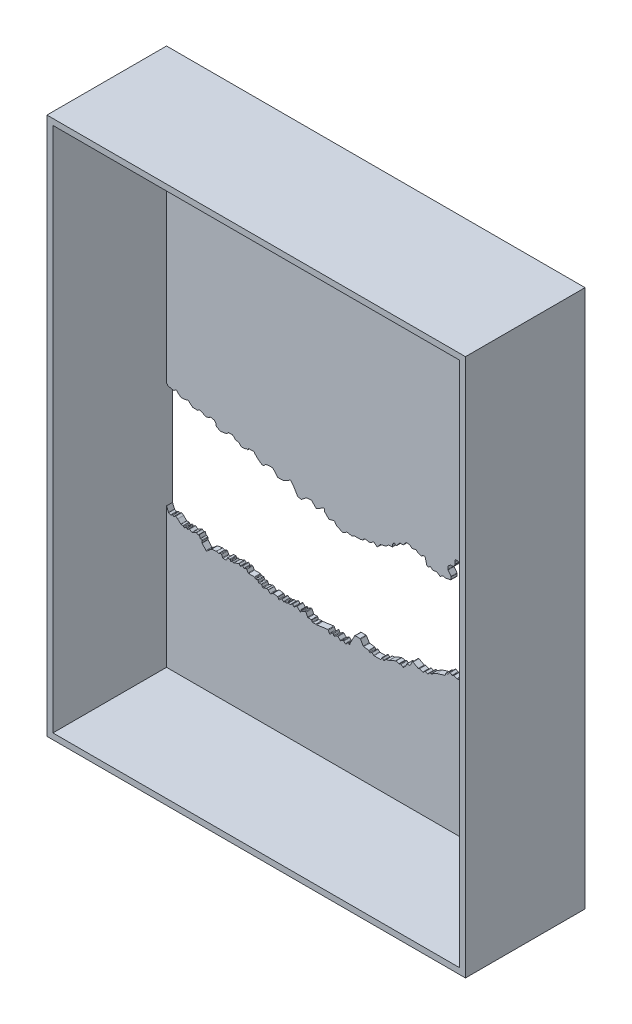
from build123d import *

# Parameters (mm, degrees)
ESQUISSE2_W             = 1400
ESQUISSE2_H             = 1800
BOSS_EXTRU_2_DEPTH      = 200
COQUE1_T                = -20
ENL_V_MAT_EXTRU_1_REACH = 1210.305


with BuildPart() as part:
    # Esquisse2 → Boss.-Extru.2 (new, symmetric)
    with BuildSketch(Plane.XY):
        Rectangle(ESQUISSE2_W, ESQUISSE2_H)
    extrude(amount=BOSS_EXTRU_2_DEPTH, both=True)

    # Coque1
    coque1_openings = [part.faces().sort_by_distance(p)[0] for p in [
        (0, 0, 200),
    ]]
    offset(amount=COQUE1_T, openings=coque1_openings, kind=Kind.INTERSECTION)

    # Esquisse3 → Enl_v. mat.-Extru.1 (cut, up to next)
    with BuildSketch(Plane(origin=(0, 0, -200), x_dir=(-1, 0, 0), z_dir=(0, 0, -1)), mode=Mode.PRIVATE) as enl_v_mat_extru_1_sk1:
        with BuildLine():
            Line((-654.54291398, -114.768213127), (-680, -103.714797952))
            Line((-680, -103.714797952), (-680, -442.152559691))
            Line((-680, -442.152559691), (-667.390305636, -434.878480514))
            ThreePointArc((-667.390305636, -434.878480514), (-665.876675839, -434.678142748), (-664.662759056, -435.604218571))
            Line((-664.662759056, -435.604218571), (-660.566050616, -442.637100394))
            ThreePointArc((-660.566050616, -442.637100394), (-659.445124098, -443.536005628), (-658.01077865, -443.451388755))
            Line((-658.01077865, -443.451388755), (-646.203287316, -438.088355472))
            ThreePointArc((-646.203287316, -438.088355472), (-644.29318571, -438.227924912), (-643.376193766, -439.909321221))
            Line((-643.376193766, -439.909321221), (-643.376193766, -442.489865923))
            ThreePointArc((-643.376193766, -442.489865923), (-642.704127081, -443.985390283), (-641.139600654, -444.475822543))
            Line((-641.139600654, -444.475822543), (-627.604242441, -442.863313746))
            ThreePointArc((-627.604242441, -442.863313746), (-627.302632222, -442.803580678), (-627.013742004, -442.698322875))
            Line((-627.013742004, -442.698322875), (-617.640432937, -438.440909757))
            ThreePointArc((-617.640432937, -438.440909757), (-616.335298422, -438.319846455), (-615.235486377, -439.032900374))
            Line((-615.235486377, -439.032900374), (-611.522286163, -443.800193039))
            ThreePointArc((-611.522286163, -443.800193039), (-611.07992687, -444.2176243), (-610.532554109, -444.482791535))
            Line((-610.532554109, -444.482791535), (-607.392830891, -445.448768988))
            ThreePointArc((-607.392830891, -445.448768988), (-606.443440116, -445.504295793), (-605.575734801, -445.115048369))
            Line((-605.575734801, -445.115048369), (-600.369980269, -441.060334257))
            ThreePointArc((-600.369980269, -441.060334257), (-599.246502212, -440.640971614), (-598.085096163, -440.939641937))
            Line((-598.085096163, -440.939641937), (-596.794924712, -441.7416833))
            ThreePointArc((-596.794924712, -441.7416833), (-595.538558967, -442.033066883), (-594.36555113, -441.496958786))
            Line((-594.36555113, -441.496958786), (-590.852134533, -438.177737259))
            ThreePointArc((-590.852134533, -438.177737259), (-589.421849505, -437.632365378), (-588.024849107, -438.258093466))
            Line((-588.024849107, -438.258093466), (-586.042866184, -440.356034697))
            ThreePointArc((-586.042866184, -440.356034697), (-584.388588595, -440.972499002), (-582.890500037, -440.038479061))
            Line((-582.890500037, -440.038479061), (-582.888270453, -440.034892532))
            Line((-582.888270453, -440.034892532), (-577.827838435, -443.180734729))
            ThreePointArc((-577.827838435, -443.180734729), (-577.078288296, -443.458586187), (-576.279795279, -443.420694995))
            Line((-576.279795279, -443.420694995), (-567.95696119, -441.307752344))
            ThreePointArc((-567.95696119, -441.307752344), (-566.442087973, -441.52753607), (-565.526321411, -442.754123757))
            Line((-565.526321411, -442.754123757), (-565.403562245, -443.237669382))
            Line((-565.403562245, -443.237669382), (-562.569204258, -441.030014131))
            ThreePointArc((-562.569204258, -441.030014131), (-561.093535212, -440.623139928), (-559.762376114, -441.378892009))
            Line((-559.762376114, -441.378892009), (-559.389959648, -441.857028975))
            ThreePointArc((-559.389959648, -441.857028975), (-558.058800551, -442.612781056), (-556.583131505, -442.205906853))
            Line((-556.583131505, -442.205906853), (-549.930527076, -437.024254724))
            ThreePointArc((-549.930527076, -437.024254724), (-548.807049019, -436.604892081), (-547.64564297, -436.903562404))
            Line((-547.64564297, -436.903562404), (-543.802440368, -439.292708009))
            ThreePointArc((-543.802440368, -439.292708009), (-542.546074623, -439.584091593), (-541.373066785, -439.047983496))
            Line((-541.373066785, -439.047983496), (-540.838706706, -438.543158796))
            ThreePointArc((-540.838706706, -438.543158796), (-539.175685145, -438.018051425), (-537.732826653, -438.997611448))
            Line((-537.732826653, -438.997611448), (-535.750353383, -442.43425015))
            ThreePointArc((-535.750353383, -442.43425015), (-535.018253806, -443.166750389), (-534.017937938, -443.434881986))
            Line((-534.017937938, -443.434881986), (-524.532228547, -443.434881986))
            ThreePointArc((-524.532228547, -443.434881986), (-523.118014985, -442.849095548), (-522.532228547, -441.434881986))
            Line((-522.532228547, -441.434881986), (-522.532228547, -439.76546203))
            ThreePointArc((-522.532228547, -439.76546203), (-521.503872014, -438.017346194), (-519.476319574, -438.066916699))
            Line((-519.476319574, -438.066916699), (-512.766510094, -442.238102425))
            ThreePointArc((-512.766510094, -442.238102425), (-511.135514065, -442.455092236), (-509.893741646, -441.37563224))
            Line((-509.893741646, -441.37563224), (-508.058013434, -437.38644513))
            ThreePointArc((-508.058013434, -437.38644513), (-506.934673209, -436.346612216), (-505.405078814, -436.405660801))
            Line((-505.405078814, -436.405660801), (-493.901938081, -441.69913022))
            ThreePointArc((-493.901938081, -441.69913022), (-492.835920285, -441.869008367), (-491.836887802, -441.460123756))
            Line((-491.836887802, -441.460123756), (-487.437200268, -438.033247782))
            ThreePointArc((-487.437200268, -438.033247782), (-485.961531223, -437.626373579), (-484.630372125, -438.38212566))
            Line((-484.630372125, -438.38212566), (-482.251191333, -441.436701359))
            ThreePointArc((-482.251191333, -441.436701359), (-481.551418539, -442.004661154), (-480.673338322, -442.207726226))
            Line((-480.673338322, -442.207726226), (-474.610302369, -442.207726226))
            Line((-474.610302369, -442.207726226), (-467.944178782, -442.207726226))
            Line((-467.944178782, -442.207726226), (-453.54953633, -444.247634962))
            ThreePointArc((-453.54953633, -444.247634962), (-452.559751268, -444.137470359), (-451.745805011, -443.563621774))
            Line((-451.745805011, -443.563621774), (-448.769821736, -440.066676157))
            ThreePointArc((-448.769821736, -440.066676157), (-447.4071604, -439.36932414), (-445.95051099, -439.839768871))
            Line((-445.95051099, -439.839768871), (-442.100261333, -443.116422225))
            ThreePointArc((-442.100261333, -443.116422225), (-440.985663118, -443.585051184), (-439.804691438, -443.325728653))
            Line((-439.804691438, -443.325728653), (-439.031043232, -442.879438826))
            ThreePointArc((-439.031043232, -442.879438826), (-437.742118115, -442.632926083), (-436.577854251, -443.238389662))
            Line((-436.577854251, -443.238389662), (-432.904448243, -447.126712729))
            ThreePointArc((-432.904448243, -447.126712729), (-432.369381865, -447.529730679), (-431.731249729, -447.733463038))
            Line((-431.731249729, -447.733463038), (-427.09659594, -448.390253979))
            ThreePointArc((-427.09659594, -448.390253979), (-425.85823144, -448.165809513), (-424.999114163, -447.246114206))
            Line((-424.999114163, -447.246114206), (-423.170660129, -443.272734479))
            ThreePointArc((-423.170660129, -443.272734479), (-422.667661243, -442.600906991), (-421.933304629, -442.194606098))
            Line((-421.933304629, -442.194606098), (-410.798814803, -438.823762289))
            ThreePointArc((-410.798814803, -438.823762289), (-409.811079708, -438.780072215), (-408.923109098, -439.2148568))
            Line((-408.923109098, -439.2148568), (-407.293657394, -440.601558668))
            Line((-407.293657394, -440.601558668), (-406.71349299, -438.715846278))
            ThreePointArc((-406.71349299, -438.715846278), (-405.73774172, -437.536416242), (-404.213798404, -437.392393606))
            Line((-404.213798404, -437.392393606), (-385.872406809, -443.035365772))
            ThreePointArc((-385.872406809, -443.035365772), (-384.851763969, -443.758714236), (-384.460527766, -444.946939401))
            Line((-384.460527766, -444.946939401), (-384.460527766, -447.57964155))
            ThreePointArc((-384.460527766, -447.57964155), (-384.144592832, -448.65849504), (-383.296602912, -449.396501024))
            Line((-383.296602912, -449.396501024), (-374.551432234, -453.420818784))
            ThreePointArc((-374.551432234, -453.420818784), (-373.140270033, -453.519494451), (-372.016811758, -452.659868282))
            Line((-372.016811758, -452.659868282), (-369.875922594, -449.216013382))
            ThreePointArc((-369.875922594, -449.216013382), (-368.660546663, -448.331162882), (-367.172168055, -448.542889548))
            Line((-367.172168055, -448.542889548), (-365.363850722, -449.594192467))
            ThreePointArc((-365.363850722, -449.594192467), (-363.846820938, -449.79856073), (-362.629608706, -448.870368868))
            Line((-362.629608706, -448.870368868), (-360.834895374, -445.783331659))
            ThreePointArc((-360.834895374, -445.783331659), (-359.335728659, -444.801794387), (-357.652041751, -445.415076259))
            Line((-357.652041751, -445.415076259), (-355.546536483, -447.643766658))
            ThreePointArc((-355.546536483, -447.643766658), (-354.244645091, -448.264523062), (-352.863740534, -447.848155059))
            Line((-352.863740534, -447.848155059), (-352.356021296, -447.452697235))
            ThreePointArc((-352.356021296, -447.452697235), (-351.262070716, -447.035113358), (-350.121836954, -447.301517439))
            Line((-350.121836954, -447.301517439), (-345.738500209, -449.849861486))
            ThreePointArc((-345.738500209, -449.849861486), (-344.73666591, -450.120825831), (-343.733922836, -449.853244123))
            Line((-343.733922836, -449.853244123), (-336.252567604, -445.537519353))
            Line((-336.252567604, -445.537519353), (-335.449127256, -446.38796595))
            Line((-335.449127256, -446.38796595), (-334.357258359, -445.537519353))
            Line((-334.357258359, -445.537519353), (-327.308928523, -449.6352126))
            ThreePointArc((-327.308928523, -449.6352126), (-326.53583628, -449.892664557), (-325.72421534, -449.820383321))
            Line((-325.72421534, -449.820383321), (-320.552987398, -448.25485118))
            ThreePointArc((-320.552987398, -448.25485118), (-320.036714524, -448.013750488), (-319.609382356, -447.636849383))
            Line((-319.609382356, -447.636849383), (-314.851681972, -442.046287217))
            ThreePointArc((-314.851681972, -442.046287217), (-314.375260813, -440.793433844), (-314.796937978, -439.521110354))
            Line((-314.796937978, -439.521110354), (-314.922283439, -439.360182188))
            ThreePointArc((-314.922283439, -439.360182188), (-315.339867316, -438.266231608), (-315.073463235, -437.125997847))
            Line((-315.073463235, -437.125997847), (-311.395813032, -430.800172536))
            ThreePointArc((-311.395813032, -430.800172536), (-310.178600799, -429.871980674), (-308.661571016, -430.076348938))
            Line((-308.661571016, -430.076348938), (-307.432865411, -430.790682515))
            ThreePointArc((-307.432865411, -430.790682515), (-306.090179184, -431.032971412), (-304.904547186, -430.357851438))
            Line((-304.904547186, -430.357851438), (-301.386211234, -426.223611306))
            ThreePointArc((-301.386211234, -426.223611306), (-300.422764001, -425.599714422), (-299.274981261, -425.608239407))
            Line((-299.274981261, -425.608239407), (-294.132804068, -427.190298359))
            ThreePointArc((-294.132804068, -427.190298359), (-293.183413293, -427.245825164), (-292.315707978, -426.85657774))
            Line((-292.315707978, -426.85657774), (-292.08161552, -426.674245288))
            Line((-292.08161552, -426.674245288), (-281.224227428, -423.387290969))
            ThreePointArc((-281.224227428, -423.387290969), (-280.412606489, -423.315009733), (-279.639514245, -423.572461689))
            Line((-279.639514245, -423.572461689), (-277.066055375, -425.068595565))
            ThreePointArc((-277.066055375, -425.068595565), (-276.100526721, -425.339169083), (-275.125023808, -425.107113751))
            Line((-275.125023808, -425.107113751), (-268.35132504, -421.520807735))
            ThreePointArc((-268.35132504, -421.520807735), (-266.827381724, -421.376785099), (-265.647951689, -422.352536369))
            Line((-265.647951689, -422.352536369), (-262.633480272, -428.046172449))
            ThreePointArc((-262.633480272, -428.046172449), (-261.897519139, -428.823774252), (-260.865929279, -429.11035009))
            Line((-260.865929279, -429.11035009), (-255.968461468, -429.11035009))
            ThreePointArc((-255.968461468, -429.11035009), (-254.77661583, -429.504266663), (-254.054257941, -430.530846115))
            Line((-254.054257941, -430.530846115), (-252.314763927, -436.276700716))
            ThreePointArc((-252.314763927, -436.276700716), (-251.817955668, -437.108221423), (-250.988681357, -437.608770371))
            Line((-250.988681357, -437.608770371), (-222.875626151, -446.258124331))
            Line((-222.875626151, -446.258124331), (-205.78358627, -456.194937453))
            ThreePointArc((-205.78358627, -456.194937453), (-205.010494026, -456.452389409), (-204.198873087, -456.380108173))
            Line((-204.198873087, -456.380108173), (-201.601809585, -455.593875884))
            ThreePointArc((-201.601809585, -455.593875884), (-200.416863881, -455.601920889), (-199.4444526, -456.279104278))
            Line((-199.4444526, -456.279104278), (-195.287280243, -461.616402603))
            ThreePointArc((-195.287280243, -461.616402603), (-194.187468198, -462.329456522), (-192.882333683, -462.20839322))
            Line((-192.882333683, -462.20839322), (-186.296827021, -459.217216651))
            ThreePointArc((-186.296827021, -459.217216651), (-185.098893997, -459.072863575), (-184.03593554, -459.643828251))
            Line((-184.03593554, -459.643828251), (-178.906561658, -464.918302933))
            ThreePointArc((-178.906561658, -464.918302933), (-177.843603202, -465.489267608), (-176.645670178, -465.344914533))
            Line((-176.645670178, -465.344914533), (-166.7376329, -460.844624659))
            ThreePointArc((-166.7376329, -460.844624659), (-165.539699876, -460.700271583), (-164.47674142, -461.271236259))
            Line((-164.47674142, -461.271236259), (-164.238555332, -461.516160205))
            ThreePointArc((-164.238555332, -461.516160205), (-163.115906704, -462.097454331), (-161.868935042, -461.889357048))
            Line((-161.868935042, -461.889357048), (-144.571613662, -452.731363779))
            ThreePointArc((-144.571613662, -452.731363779), (-143.047670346, -452.587341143), (-141.86824031, -453.563092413))
            Line((-141.86824031, -453.563092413), (-134.905963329, -466.713215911))
            ThreePointArc((-134.905963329, -466.713215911), (-134.170002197, -467.490817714), (-133.138412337, -467.777393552))
            Line((-133.138412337, -467.777393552), (-131.706960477, -467.777393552))
            Line((-131.706960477, -467.777393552), (-124.606157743, -467.777393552))
            ThreePointArc((-124.606157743, -467.777393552), (-123.414312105, -468.171310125), (-122.691954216, -469.197889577))
            Line((-122.691954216, -469.197889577), (-120.791248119, -475.476256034))
            ThreePointArc((-120.791248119, -475.476256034), (-120.599912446, -475.912491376), (-120.310842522, -476.291106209))
            Line((-120.310842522, -476.291106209), (-113.378338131, -483.419718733))
            ThreePointArc((-113.378338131, -483.419718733), (-112.082039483, -484.020632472), (-110.715565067, -483.603217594))
            Line((-110.715565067, -483.603217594), (-104.721757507, -478.934696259))
            ThreePointArc((-104.721757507, -478.934696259), (-103.722725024, -478.525811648), (-102.656707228, -478.695689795))
            Line((-102.656707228, -478.695689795), (-98.517294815, -480.600548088))
            ThreePointArc((-98.517294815, -480.600548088), (-97.818428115, -480.778976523), (-97.101715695, -480.69789214))
            Line((-97.101715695, -480.69789214), (-87.662627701, -477.84031251))
            ThreePointArc((-87.662627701, -477.84031251), (-86.945915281, -477.759228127), (-86.247048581, -477.937656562))
            Line((-86.247048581, -477.937656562), (-76.479672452, -482.432368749))
            Line((-76.479672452, -482.432368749), (-64.311590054, -488.031828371))
            ThreePointArc((-64.311590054, -488.031828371), (-64.039806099, -488.133712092), (-63.756137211, -488.195183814))
            Line((-63.756137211, -488.195183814), (-55.770120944, -489.326906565))
            ThreePointArc((-55.770120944, -489.326906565), (-55.144863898, -489.524039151), (-54.616945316, -489.912767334))
            Line((-54.616945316, -489.912767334), (-48.725443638, -495.970929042))
            ThreePointArc((-48.725443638, -495.970929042), (-47.319536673, -496.576380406), (-45.897291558, -496.010372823))
            Line((-45.897291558, -496.010372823), (-42.404536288, -492.613703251))
            ThreePointArc((-42.404536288, -492.613703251), (-40.510166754, -492.111013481), (-39.095978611, -493.467997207))
            Line((-39.095978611, -493.467997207), (-37.772983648, -497.838082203))
            ThreePointArc((-37.772983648, -497.838082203), (-37.050625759, -498.864661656), (-35.858780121, -499.258578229))
            Line((-35.858780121, -499.258578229), (-14.226174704, -499.258578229))
            ThreePointArc((-14.226174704, -499.258578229), (-13.473710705, -499.111629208), (-12.831820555, -498.69237616))
            Line((-12.831820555, -498.69237616), (-7.928117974, -493.923574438))
            ThreePointArc((-7.928117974, -493.923574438), (-6.50587286, -493.357566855), (-5.099965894, -493.96301822))
            Line((-5.099965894, -493.96301822), (-2.408935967, -496.730172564))
            ThreePointArc((-2.408935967, -496.730172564), (-0.730905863, -497.320850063), (0.75389477, -496.341027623))
            Line((0.75389477, -496.341027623), (2.468420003, -493.391919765))
            ThreePointArc((2.468420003, -493.391919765), (3.099095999, -492.725718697), (3.960859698, -492.411172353))
            Line((3.960859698, -492.411172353), (20.503971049, -490.440340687))
            ThreePointArc((20.503971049, -490.440340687), (21.365734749, -490.125794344), (21.996410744, -489.459593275))
            Line((21.996410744, -489.459593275), (31.05172451, -473.883796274))
            ThreePointArc((31.05172451, -473.883796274), (31.783365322, -473.155451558), (32.780757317, -472.889005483))
            Line((32.780757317, -472.889005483), (48.863068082, -472.889005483))
            ThreePointArc((48.863068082, -472.889005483), (49.894657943, -473.175581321), (50.630619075, -473.953183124))
            Line((50.630619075, -473.953183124), (66.268257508, -503.48904864))
            ThreePointArc((66.268257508, -503.48904864), (66.441724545, -503.942741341), (66.500706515, -504.424870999))
            Line((66.500706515, -504.424870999), (66.500706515, -505.805767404))
            ThreePointArc((66.500706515, -505.805767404), (67.722473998, -507.648144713), (69.895060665, -507.239565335))
            Line((69.895060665, -507.239565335), (71.038740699, -506.127347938))
            ThreePointArc((71.038740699, -506.127347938), (72.460985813, -505.561340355), (73.866892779, -506.16679172))
            Line((73.866892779, -506.16679172), (79.668196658, -512.132204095))
            ThreePointArc((79.668196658, -512.132204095), (81.074103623, -512.73765546), (82.496348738, -512.171647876))
            Line((82.496348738, -512.171647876), (87.226486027, -507.571636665))
            ThreePointArc((87.226486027, -507.571636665), (88.376608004, -507.020402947), (89.626049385, -507.276401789))
            Line((89.626049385, -507.276401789), (96.73064639, -511.406807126))
            ThreePointArc((96.73064639, -511.406807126), (97.980087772, -511.662805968), (99.130209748, -511.11157225))
            Line((99.130209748, -511.11157225), (106.420812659, -504.021533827))
            ThreePointArc((106.420812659, -504.021533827), (107.570934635, -503.470300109), (108.820376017, -503.726298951))
            Line((108.820376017, -503.726298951), (117.819230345, -508.957970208))
            ThreePointArc((117.819230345, -508.957970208), (119.427794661, -509.135757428), (120.641299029, -508.065012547))
            Line((120.641299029, -508.065012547), (122.550340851, -503.916508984))
            ThreePointArc((122.550340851, -503.916508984), (124.028669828, -502.781443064), (125.800998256, -503.35822998))
            Line((125.800998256, -503.35822998), (131.865731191, -509.594523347))
            ThreePointArc((131.865731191, -509.594523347), (133.638059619, -510.171310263), (135.116388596, -509.036244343))
            Line((135.116388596, -509.036244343), (138.545106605, -501.585360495))
            ThreePointArc((138.545106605, -501.585360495), (139.404223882, -500.665665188), (140.642588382, -500.441220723))
            Line((140.642588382, -500.441220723), (177.716794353, -505.695119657))
            Line((177.716794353, -505.695119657), (180.217619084, -504.938022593))
            Line((180.217619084, -504.938022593), (190.054631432, -506.33205565))
            ThreePointArc((190.054631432, -506.33205565), (191.292995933, -506.107611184), (192.15211321, -505.187915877))
            Line((192.15211321, -505.187915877), (194.150073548, -500.846185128))
            ThreePointArc((194.150073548, -500.846185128), (194.888079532, -499.998195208), (195.966933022, -499.682260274))
            Line((195.966933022, -499.682260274), (206.141798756, -499.682260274))
            ThreePointArc((206.141798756, -499.682260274), (207.220652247, -499.36632534), (207.958658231, -498.51833542))
            Line((207.958658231, -498.51833542), (213.241016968, -487.039339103))
            ThreePointArc((213.241016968, -487.039339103), (214.454521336, -485.968594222), (216.063085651, -486.146381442))
            Line((216.063085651, -486.146381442), (224.712687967, -491.175007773))
            ThreePointArc((224.712687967, -491.175007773), (226.229717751, -491.379376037), (227.446929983, -490.451184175))
            Line((227.446929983, -490.451184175), (228.597990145, -488.47127714))
            Line((228.597990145, -488.47127714), (230.091847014, -487.680360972))
            Line((230.091847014, -487.680360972), (230.091847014, -493.53809691))
            ThreePointArc((230.091847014, -493.53809691), (231.313614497, -495.380474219), (233.486201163, -494.971894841))
            Line((233.486201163, -494.971894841), (243.316671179, -485.411861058))
            ThreePointArc((243.316671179, -485.411861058), (244.738916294, -484.845853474), (246.144823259, -485.451304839))
            Line((246.144823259, -485.451304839), (251.294268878, -490.746419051))
            ThreePointArc((251.294268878, -490.746419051), (252.700175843, -491.351870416), (254.122420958, -490.785862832))
            Line((254.122420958, -490.785862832), (258.190542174, -486.829655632))
            ThreePointArc((258.190542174, -486.829655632), (259.612787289, -486.263648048), (261.018694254, -486.869099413))
            Line((261.018694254, -486.869099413), (264.887192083, -490.847030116))
            ThreePointArc((264.887192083, -490.847030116), (265.818985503, -491.388648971), (266.896559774, -491.368066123))
            Line((266.896559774, -491.368066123), (271.801149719, -489.894249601))
            ThreePointArc((271.801149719, -489.894249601), (272.610877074, -489.823394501), (273.381928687, -490.080606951))
            Line((273.381928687, -490.080606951), (278.878796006, -493.276325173))
            ThreePointArc((278.878796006, -493.276325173), (280.395825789, -493.480693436), (281.613038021, -492.552501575))
            Line((281.613038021, -492.552501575), (281.657766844, -492.475564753))
            ThreePointArc((281.657766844, -492.475564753), (283.142567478, -491.495742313), (284.820597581, -492.086419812))
            Line((284.820597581, -492.086419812), (286.165298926, -493.469160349))
            ThreePointArc((286.165298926, -493.469160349), (287.571205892, -494.074611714), (288.993451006, -493.508604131))
            Line((288.993451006, -493.508604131), (293.312374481, -489.308494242))
            ThreePointArc((293.312374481, -489.308494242), (294.734619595, -488.742486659), (296.140526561, -489.347938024))
            Line((296.140526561, -489.347938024), (301.832235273, -495.200654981))
            ThreePointArc((301.832235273, -495.200654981), (303.632188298, -495.772497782), (305.105637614, -494.59106552))
            Line((305.105637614, -494.59106552), (306.913198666, -490.353875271))
            ThreePointArc((306.913198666, -490.353875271), (307.553484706, -489.538128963), (308.516209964, -489.152683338))
            Line((308.516209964, -489.152683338), (323.130090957, -487.41168681))
            ThreePointArc((323.130090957, -487.41168681), (323.944827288, -487.483028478), (324.662885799, -487.874534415))
            Line((324.662885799, -487.874534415), (330.66835755, -492.985332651))
            ThreePointArc((330.66835755, -492.985332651), (332.125006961, -493.455777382), (333.487668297, -492.758425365))
            Line((333.487668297, -492.758425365), (339.337391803, -485.884675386))
            ThreePointArc((339.337391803, -485.884675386), (339.766443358, -485.506649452), (340.284931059, -485.26548696))
            Line((340.284931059, -485.26548696), (344.552176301, -483.983190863))
            ThreePointArc((344.552176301, -483.983190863), (345.238995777, -483.901677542), (345.912510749, -484.05897661))
            Line((345.912510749, -484.05897661), (356.334178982, -488.504800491))
            ThreePointArc((356.334178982, -488.504800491), (357.864827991, -488.520905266), (358.95854808, -487.449960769))
            Line((358.95854808, -487.449960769), (361.485698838, -481.5259459))
            ThreePointArc((361.485698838, -481.5259459), (362.34301937, -480.568551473), (363.60592555, -480.33049567))
            Line((363.60592555, -480.33049567), (369.974036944, -481.23294018))
            ThreePointArc((369.974036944, -481.23294018), (371.236943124, -480.994884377), (372.094263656, -480.03748995))
            Line((372.094263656, -480.03748995), (373.98256692, -475.611028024))
            ThreePointArc((373.98256692, -475.611028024), (374.839887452, -474.653633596), (376.102793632, -474.415577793))
            Line((376.102793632, -474.415577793), (381.26367703, -475.146942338))
            ThreePointArc((381.26367703, -475.146942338), (382.417301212, -474.966135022), (383.273332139, -474.171936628))
            Line((383.273332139, -474.171936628), (384.546097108, -471.982688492))
            ThreePointArc((384.546097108, -471.982688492), (385.27773792, -471.254343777), (386.275129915, -470.987897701))
            Line((386.275129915, -470.987897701), (405.242318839, -470.987897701))
            ThreePointArc((405.242318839, -470.987897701), (406.239710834, -470.721451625), (406.971351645, -469.99310691))
            Line((406.971351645, -469.99310691), (411.516077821, -462.175847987))
            ThreePointArc((411.516077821, -462.175847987), (412.615059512, -461.282890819), (414.029875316, -461.341452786))
            Line((414.029875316, -461.341452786), (419.013958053, -463.467633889))
            ThreePointArc((419.013958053, -463.467633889), (420.164877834, -463.594226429), (421.19307689, -463.06182741))
            Line((421.19307689, -463.06182741), (425.005965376, -459.353831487))
            ThreePointArc((425.005965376, -459.353831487), (426.42821049, -458.787823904), (427.834117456, -459.393275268))
            Line((427.834117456, -459.393275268), (430.910085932, -462.556257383))
            ThreePointArc((430.910085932, -462.556257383), (432.315992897, -463.161708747), (433.738238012, -462.595701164))
            Line((433.738238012, -462.595701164), (437.315751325, -459.116605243))
            ThreePointArc((437.315751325, -459.116605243), (438.343950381, -458.584206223), (439.494870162, -458.710798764))
            Line((439.494870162, -458.710798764), (454.639459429, -465.171393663))
            ThreePointArc((454.639459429, -465.171393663), (455.59729619, -465.324286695), (456.514425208, -465.008530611))
            Line((456.514425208, -465.008530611), (459.232312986, -463.24138614))
            ThreePointArc((459.232312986, -463.24138614), (460.737260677, -462.96160373), (461.999255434, -463.827926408))
            Line((461.999255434, -463.827926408), (462.522577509, -464.632801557))
            ThreePointArc((462.522577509, -464.632801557), (464.37239094, -465.535097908), (466.038923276, -464.327365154))
            Line((466.038923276, -464.327365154), (466.983472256, -462.113202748))
            ThreePointArc((466.983472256, -462.113202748), (467.720699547, -461.229206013), (468.823076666, -460.897967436))
            Line((468.823076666, -460.897967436), (475.382304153, -460.897967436))
            ThreePointArc((475.382304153, -460.897967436), (476.575799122, -461.293109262), (477.29769431, -462.322397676))
            Line((477.29769431, -462.322397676), (479.078644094, -468.249070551))
            ThreePointArc((479.078644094, -468.249070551), (479.800539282, -469.278358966), (480.994034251, -469.673500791))
            Line((480.994034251, -469.673500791), (490.702241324, -469.673500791))
            ThreePointArc((490.702241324, -469.673500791), (491.804618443, -469.342262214), (492.541845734, -468.458265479))
            Line((492.541845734, -468.458265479), (495.739364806, -460.962808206))
            ThreePointArc((495.739364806, -460.962808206), (496.833084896, -459.891863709), (498.363733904, -459.907968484))
            Line((498.363733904, -459.907968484), (504.178306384, -462.388431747))
            ThreePointArc((504.178306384, -462.388431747), (504.851821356, -462.545730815), (505.538640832, -462.464217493))
            Line((505.538640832, -462.464217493), (512.442769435, -460.389544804))
            ThreePointArc((512.442769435, -460.389544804), (512.867345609, -460.310642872), (513.298961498, -460.324720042))
            Line((513.298961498, -460.324720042), (529.293686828, -462.591381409))
            ThreePointArc((529.293686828, -462.591381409), (529.833935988, -462.747817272), (530.309266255, -463.048487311))
            Line((530.309266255, -463.048487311), (545.348612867, -475.847326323))
            ThreePointArc((545.348612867, -475.847326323), (546.805262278, -476.317771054), (548.167923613, -475.620419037))
            Line((548.167923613, -475.620419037), (560.760521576, -460.823417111))
            ThreePointArc((560.760521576, -460.823417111), (561.114407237, -460.21778832), (561.23741256, -459.527215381))
            Line((561.23741256, -459.527215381), (561.23741256, -454.534448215))
            ThreePointArc((561.23741256, -454.534448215), (561.55601625, -453.451440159), (562.41031901, -452.713482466))
            Line((562.41031901, -452.713482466), (566.078637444, -451.047310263))
            ThreePointArc((566.078637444, -451.047310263), (566.682015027, -450.624111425), (567.091148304, -450.011109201))
            Line((567.091148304, -450.011109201), (570.800601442, -441.31560282))
            Line((570.800601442, -441.31560282), (571.902253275, -443.009955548))
            ThreePointArc((571.902253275, -443.009955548), (573.164248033, -443.876278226), (574.669195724, -443.596495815))
            Line((574.669195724, -443.596495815), (579.637621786, -440.366073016))
            ThreePointArc((579.637621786, -440.366073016), (580.554750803, -440.050316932), (581.512587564, -440.203209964))
            Line((581.512587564, -440.203209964), (591.307726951, -444.381760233))
            ThreePointArc((591.307726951, -444.381760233), (591.920729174, -444.79089351), (592.343928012, -445.394271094))
            Line((592.343928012, -445.394271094), (592.365869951, -445.442579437))
            ThreePointArc((592.365869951, -445.442579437), (593.626496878, -446.535387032), (595.277036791, -446.292227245))
            Line((595.277036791, -446.292227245), (602.760068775, -441.426831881))
            ThreePointArc((602.760068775, -441.426831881), (604.07264417, -441.115974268), (605.284067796, -441.70921909))
            Line((605.284067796, -441.70921909), (608.080070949, -444.584316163))
            ThreePointArc((608.080070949, -444.584316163), (609.758101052, -445.174993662), (611.242901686, -444.195171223))
            Line((611.242901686, -444.195171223), (611.764665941, -443.297698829))
            ThreePointArc((611.764665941, -443.297698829), (612.981878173, -442.369506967), (614.498907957, -442.573875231))
            Line((614.498907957, -442.573875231), (619.478691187, -445.468975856))
            ThreePointArc((619.478691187, -445.468975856), (620.99572097, -445.67334412), (622.212933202, -444.745152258))
            Line((622.212933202, -444.745152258), (623.481307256, -442.563456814))
            ThreePointArc((623.481307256, -442.563456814), (624.212948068, -441.835112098), (625.210340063, -441.568666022))
            Line((625.210340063, -441.568666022), (631.263954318, -441.568666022))
            ThreePointArc((631.263954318, -441.568666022), (632.016418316, -441.421717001), (632.658308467, -441.002463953))
            Line((632.658308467, -441.002463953), (642.663445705, -431.272568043))
            ThreePointArc((642.663445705, -431.272568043), (642.809597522, -431.143678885), (642.967598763, -431.029624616))
            Line((642.967598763, -431.029624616), (649.012080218, -427.099560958))
            ThreePointArc((649.012080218, -427.099560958), (650.56343893, -426.83019501), (651.828963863, -427.767061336))
            Line((651.828963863, -427.767061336), (653.073380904, -429.896100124))
            ThreePointArc((653.073380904, -429.896100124), (654.292755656, -430.821449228), (655.809304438, -430.613541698))
            Line((655.809304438, -430.613541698), (658.541175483, -429.01677094))
            ThreePointArc((658.541175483, -429.01677094), (659.577663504, -428.743639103), (660.606325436, -429.044908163))
            Line((660.606325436, -429.044908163), (665.087345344, -431.830556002))
            ThreePointArc((665.087345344, -431.830556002), (666.116007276, -432.131825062), (667.152495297, -431.858693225))
            Line((667.152495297, -431.858693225), (672.484823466, -428.741962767))
            ThreePointArc((672.484823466, -428.741962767), (672.975843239, -428.337860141), (673.315186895, -427.8000449))
            Line((673.315186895, -427.8000449), (680, -412.129855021))
            Line((680, -412.129855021), (680, -57.316072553))
            Line((680, -57.316072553), (678.857892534, -57.554342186))
            ThreePointArc((678.857892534, -57.554342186), (677.68416987, -58.269047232), (677.224232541, -59.563993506))
            Line((677.224232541, -59.563993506), (677.224232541, -60.027852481))
            ThreePointArc((677.224232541, -60.027852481), (676.76231501, -61.325230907), (675.584430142, -62.038775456))
            Line((675.584430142, -62.038775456), (657.407536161, -65.772969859))
            ThreePointArc((657.407536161, -65.772969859), (656.662548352, -65.78796349), (655.961282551, -65.536054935))
            Line((655.961282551, -65.536054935), (648.418700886, -61.143448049))
            ThreePointArc((648.418700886, -61.143448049), (647.020449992, -60.897265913), (645.796826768, -61.617305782))
            Line((645.796826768, -61.617305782), (643.155480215, -64.84493671))
            ThreePointArc((643.155480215, -64.84493671), (642.989652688, -65.024585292), (642.803644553, -65.183246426))
            Line((642.803644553, -65.183246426), (632.076089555, -73.28166103))
            ThreePointArc((632.076089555, -73.28166103), (631.491434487, -73.589749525), (630.839188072, -73.69612003))
            Line((630.839188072, -73.69612003), (621.207723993, -73.69612003))
            ThreePointArc((621.207723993, -73.69612003), (620.944064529, -73.67911854), (620.684772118, -73.628395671))
            Line((620.684772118, -73.628395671), (608.610089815, -70.447610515))
            ThreePointArc((608.610089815, -70.447610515), (607.621743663, -70.433334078), (606.741288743, -70.882590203))
            Line((606.741288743, -70.882590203), (604.138109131, -73.14259105))
            Line((604.138109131, -73.14259105), (593.327517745, -82.528015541))
            ThreePointArc((593.327517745, -82.528015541), (592.719114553, -82.893694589), (592.022543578, -83.030312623))
            Line((592.022543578, -83.030312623), (576.288494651, -83.343650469))
            ThreePointArc((576.288494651, -83.343650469), (575.576638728, -83.231308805), (574.947469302, -82.879875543))
            Line((574.947469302, -82.879875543), (570.417673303, -79.172896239))
            ThreePointArc((570.417673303, -79.172896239), (569.382339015, -78.725865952), (568.2670943, -78.893145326))
            Line((568.2670943, -78.893145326), (561.23741256, -82.092653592))
            Line((561.23741256, -82.092653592), (548.245102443, -88.006008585))
            ThreePointArc((548.245102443, -88.006008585), (547.568499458, -88.183067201), (546.871721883, -88.122715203))
            Line((546.871721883, -88.122715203), (538.07589585, -85.805666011))
            ThreePointArc((538.07589585, -85.805666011), (537.372161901, -85.466593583), (536.846039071, -84.889180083))
            Line((536.846039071, -84.889180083), (535.260110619, -82.288069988))
            ThreePointArc((535.260110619, -82.288069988), (534.326225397, -81.474269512), (533.094185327, -81.345855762))
            Line((533.094185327, -81.345855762), (521.20334817, -83.788665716))
            ThreePointArc((521.20334817, -83.788665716), (520.558432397, -84.040314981), (520.0338294, -84.492017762))
            Line((520.0338294, -84.492017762), (514.318235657, -91.409960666))
            ThreePointArc((514.318235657, -91.409960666), (513.969097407, -92.02274594), (513.847952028, -92.717531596))
            Line((513.847952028, -92.717531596), (513.847952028, -96.862851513))
            ThreePointArc((513.847952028, -96.862851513), (513.585067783, -97.867964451), (512.863741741, -98.615660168))
            Line((512.863741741, -98.615660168), (502.154556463, -105.145180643))
            ThreePointArc((502.154556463, -105.145180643), (501.640871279, -105.368839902), (501.085847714, -105.445291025))
            Line((501.085847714, -105.445291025), (495.040987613, -105.445291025))
            ThreePointArc((495.040987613, -105.445291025), (494.851234, -105.436502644), (494.663105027, -105.410212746))
            Line((494.663105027, -105.410212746), (479.506681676, -102.571857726))
            Line((479.506681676, -102.571857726), (476.3586443, -99.99564692))
            ThreePointArc((476.3586443, -99.99564692), (476.178995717, -99.829819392), (476.020334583, -99.643811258))
            Line((476.020334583, -99.643811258), (474.029901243, -97.00718617))
            ThreePointArc((474.029901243, -97.00718617), (473.30665101, -96.406462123), (472.391441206, -96.191168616))
            Line((472.391441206, -96.191168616), (460.25447809, -96.191168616))
            ThreePointArc((460.25447809, -96.191168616), (459.602231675, -96.297539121), (459.017576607, -96.605627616))
            Line((459.017576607, -96.605627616), (454.920707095, -99.698424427))
            Line((454.920707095, -99.698424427), (449.737105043, -104.99863103))
            ThreePointArc((449.737105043, -104.99863103), (449.255613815, -105.363758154), (448.688676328, -105.572883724))
            Line((448.688676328, -105.572883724), (445.6725944, -106.202107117))
            Line((445.6725944, -106.202107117), (438.119888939, -107.77777352))
            ThreePointArc((438.119888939, -107.77777352), (437.518977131, -108.005928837), (437.018073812, -108.4087262))
            Line((437.018073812, -108.4087262), (430.821454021, -115.24525888))
            ThreePointArc((430.821454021, -115.24525888), (430.132281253, -115.743370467), (429.300379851, -115.919479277))
            Line((429.300379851, -115.919479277), (417.798948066, -115.919479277))
            ThreePointArc((417.798948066, -115.919479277), (417.023889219, -115.76754955), (416.36354944, -115.334247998))
            Line((416.36354944, -115.334247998), (414.603327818, -113.612751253))
            ThreePointArc((414.603327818, -113.612751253), (413.743746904, -113.10992879), (412.748670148, -113.070787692))
            Line((412.748670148, -113.070787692), (408.865187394, -113.880970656))
            ThreePointArc((408.865187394, -113.880970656), (407.150982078, -113.464301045), (406.393009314, -111.871319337))
            Line((406.393009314, -111.871319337), (406.393009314, -110.928900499))
            ThreePointArc((406.393009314, -110.928900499), (405.79172325, -109.477267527), (404.340090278, -108.875981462))
            Line((404.340090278, -108.875981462), (387.762589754, -108.875981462))
            ThreePointArc((387.762589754, -108.875981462), (386.310956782, -109.477267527), (385.709670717, -110.928900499))
            Line((385.709670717, -110.928900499), (385.709670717, -111.193517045))
            ThreePointArc((385.709670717, -111.193517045), (385.55774099, -111.968575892), (385.124439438, -112.628915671))
            Line((385.124439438, -112.628915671), (377.500494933, -120.42435996))
            Line((377.500494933, -120.42435996), (362.087467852, -132.607942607))
            ThreePointArc((362.087467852, -132.607942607), (361.48827169, -132.936592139), (360.814397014, -133.05034396))
            Line((360.814397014, -133.05034396), (355.822167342, -133.05034396))
            ThreePointArc((355.822167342, -133.05034396), (355.047108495, -132.898414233), (354.386768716, -132.465112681))
            Line((354.386768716, -132.465112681), (348.748666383, -126.951048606))
            ThreePointArc((348.748666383, -126.951048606), (348.260719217, -126.597524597), (347.691150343, -126.400895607))
            Line((347.691150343, -126.400895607), (337.710468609, -124.531805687))
            Line((337.710468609, -124.531805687), (326.174738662, -124.531805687))
            ThreePointArc((326.174738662, -124.531805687), (325.378585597, -124.692472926), (324.707050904, -125.149326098))
            Line((324.707050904, -125.149326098), (316.979855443, -133.05034396))
            Line((316.979855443, -133.05034396), (308.970602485, -143.066950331))
            ThreePointArc((308.970602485, -143.066950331), (308.256755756, -143.635088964), (307.367227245, -143.837814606))
            Line((307.367227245, -143.837814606), (302.261415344, -143.837814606))
            Line((302.261415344, -143.837814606), (291.737477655, -143.837814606))
            Line((291.737477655, -143.837814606), (291.726898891, -143.829355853))
            Line((291.726898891, -143.829355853), (273.198175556, -135.272893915))
            ThreePointArc((273.198175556, -135.272893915), (272.97960809, -135.15544424), (272.776806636, -135.012483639))
            Line((272.776806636, -135.012483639), (267.015768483, -130.405972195))
            ThreePointArc((267.015768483, -130.405972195), (265.506505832, -129.969040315), (264.130338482, -130.727292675))
            Line((264.130338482, -130.727292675), (255.746257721, -141.212669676))
            Line((255.746257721, -141.212669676), (252.688623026, -146.462959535))
            Line((252.688623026, -146.462959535), (241.85221129, -165.070251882))
            ThreePointArc((241.85221129, -165.070251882), (241.278619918, -165.702490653), (240.497462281, -166.046766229))
            Line((240.497462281, -166.046766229), (230.091847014, -168.217614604))
            ThreePointArc((230.091847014, -168.217614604), (229.195755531, -168.204737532), (228.390533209, -167.811338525))
            Line((228.390533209, -167.811338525), (212.644360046, -155.220738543))
            ThreePointArc((212.644360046, -155.220738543), (212.217754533, -154.95791895), (211.740187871, -154.806273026))
            Line((211.740187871, -154.806273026), (206.438193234, -153.813364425))
            Line((206.438193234, -153.813364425), (194.685683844, -153.813364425))
            ThreePointArc((194.685683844, -153.813364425), (193.796155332, -154.016090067), (193.082308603, -154.584228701))
            Line((193.082308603, -154.584228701), (188.942252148, -159.761904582))
            Line((188.942252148, -159.761904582), (180.217619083, -168.682797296))
            ThreePointArc((180.217619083, -168.682797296), (179.025381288, -169.281754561), (177.716794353, -169.021406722))
            Line((177.716794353, -169.021406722), (168.971358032, -163.928288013))
            Line((168.971358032, -163.928288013), (154.688994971, -155.610604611))
            ThreePointArc((154.688994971, -155.610604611), (152.632742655, -155.604806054), (151.602938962, -157.384612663))
            Line((151.602938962, -157.384612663), (151.602938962, -163.346853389))
            ThreePointArc((151.602938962, -163.346853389), (151.451009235, -164.121912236), (151.017707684, -164.782252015))
            Line((151.017707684, -164.782252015), (137.55288915, -178.549960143))
            ThreePointArc((137.55288915, -178.549960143), (136.631736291, -179.093393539), (135.562249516, -179.099756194))
            Line((135.562249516, -179.099756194), (119.721469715, -174.926883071))
            ThreePointArc((119.721469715, -174.926883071), (118.398710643, -175.021367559), (117.409695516, -175.904808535))
            Line((117.409695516, -175.904808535), (113.009502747, -183.719167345))
            ThreePointArc((113.009502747, -183.719167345), (112.622205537, -184.211966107), (112.104266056, -184.564936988))
            Line((112.104266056, -184.564936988), (91.745811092, -194.272471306))
            ThreePointArc((91.745811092, -194.272471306), (90.792545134, -194.471168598), (89.854956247, -194.208254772))
            Line((89.854956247, -194.208254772), (76.660362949, -186.778502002))
            ThreePointArc((76.660362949, -186.778502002), (75.970247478, -186.539051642), (75.239977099, -186.556401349))
            Line((75.239977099, -186.556401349), (59.941861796, -189.699190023))
            ThreePointArc((59.941861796, -189.699190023), (59.211591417, -189.71653973), (58.521475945, -189.47708937))
            Line((58.521475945, -189.47708937), (51.074463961, -185.283746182))
            ThreePointArc((51.074463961, -185.283746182), (50.587852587, -185.086770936), (50.067194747, -185.019649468))
            Line((50.067194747, -185.019649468), (35.053218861, -185.019649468))
            Line((35.053218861, -185.019649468), (31.630066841, -185.019649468))
            Line((31.630066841, -185.019649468), (23.024829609, -182.75280632))
            ThreePointArc((23.024829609, -182.75280632), (21.921734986, -182.02078735), (21.494862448, -180.767611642))
            Line((21.494862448, -180.767611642), (21.494862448, -180.510811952))
            ThreePointArc((21.494862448, -180.510811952), (21.22175002, -179.487696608), (20.475080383, -178.7368039))
            Line((20.475080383, -178.7368039), (16.789705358, -176.590535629))
            ThreePointArc((16.789705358, -176.590535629), (16.29162991, -176.382578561), (15.756568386, -176.311624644))
            Line((15.756568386, -176.311624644), (12.663089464, -176.311624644))
            Line((12.663089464, -176.311624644), (0.839109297, -178.740699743))
            ThreePointArc((0.839109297, -178.740699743), (0.032853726, -178.744700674), (-0.712761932, -178.437908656))
            Line((-0.712761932, -178.437908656), (-11.929208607, -170.96027754))
            ThreePointArc((-11.929208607, -170.96027754), (-13.150983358, -170.617169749), (-14.341034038, -171.057891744))
            Line((-14.341034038, -171.057891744), (-23.196157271, -178.057628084))
            ThreePointArc((-23.196157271, -178.057628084), (-24.707839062, -178.486115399), (-26.079745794, -177.720181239))
            Line((-26.079745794, -177.720181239), (-34.24035189, -167.396482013))
            ThreePointArc((-34.24035189, -167.396482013), (-34.726279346, -166.952062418), (-35.327917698, -166.684358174))
            Line((-35.327917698, -166.684358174), (-54.180984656, -161.717970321))
            ThreePointArc((-54.180984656, -161.717970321), (-54.670819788, -161.51847972), (-55.093431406, -161.200463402))
            Line((-55.093431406, -161.200463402), (-62.048306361, -154.398595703))
            ThreePointArc((-62.048306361, -154.398595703), (-62.70864614, -153.965294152), (-63.483704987, -153.813364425))
            Line((-63.483704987, -153.813364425), (-74.426753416, -153.813364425))
            ThreePointArc((-74.426753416, -153.813364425), (-75.878386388, -153.21207836), (-76.479672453, -151.760445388))
            Line((-76.479672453, -151.760445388), (-76.479672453, -144.861367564))
            ThreePointArc((-76.479672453, -144.861367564), (-76.593424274, -144.187492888), (-76.922073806, -143.588296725))
            Line((-76.922073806, -143.588296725), (-79.847142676, -139.88789373))
            ThreePointArc((-79.847142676, -139.88789373), (-81.219049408, -139.12195957), (-82.730731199, -139.550446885))
            Line((-82.730731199, -139.550446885), (-86.936371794, -142.874892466))
            ThreePointArc((-86.936371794, -142.874892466), (-88.448053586, -143.303379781), (-89.819960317, -142.537445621))
            Line((-89.819960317, -142.537445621), (-97.827971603, -132.406788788))
            Line((-97.827971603, -132.406788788), (-99.515121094, -130.272434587))
            ThreePointArc((-99.515121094, -130.272434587), (-100.230941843, -129.697805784), (-101.125638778, -129.492586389))
            Line((-101.125638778, -129.492586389), (-110.939431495, -129.492586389))
            ThreePointArc((-110.939431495, -129.492586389), (-111.83412843, -129.287366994), (-112.549949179, -128.712738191))
            Line((-112.549949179, -128.712738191), (-118.332335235, -121.397642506))
            Line((-118.332335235, -121.397642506), (-120.650206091, -118.465384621))
            ThreePointArc((-120.650206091, -118.465384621), (-121.36602684, -117.890755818), (-122.260723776, -117.685536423))
            Line((-122.260723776, -117.685536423), (-131.706960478, -117.685536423))
            ThreePointArc((-131.706960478, -117.685536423), (-132.380835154, -117.799288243), (-132.980031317, -118.127937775))
            Line((-132.980031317, -118.127937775), (-141.008039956, -124.473862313))
            ThreePointArc((-141.008039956, -124.473862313), (-141.861867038, -124.872999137), (-142.80406267, -124.848539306))
            Line((-142.80406267, -124.848539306), (-153.145069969, -122.124449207))
            ThreePointArc((-153.145069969, -122.124449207), (-154.087265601, -122.099989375), (-154.941092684, -122.4991262))
            Line((-154.941092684, -122.4991262), (-160.101619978, -126.578383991))
            Line((-160.101619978, -126.578383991), (-170.846429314, -131.701837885))
            ThreePointArc((-170.846429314, -131.701837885), (-172.194986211, -131.848368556), (-173.34053263, -131.121869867))
            Line((-173.34053263, -131.121869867), (-176.315586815, -127.358232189))
            ThreePointArc((-176.315586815, -127.358232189), (-177.031407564, -126.783603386), (-177.926104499, -126.578383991))
            Line((-177.926104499, -126.578383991), (-183.031198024, -126.578383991))
            ThreePointArc((-183.031198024, -126.578383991), (-184.284373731, -127.005256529), (-185.016392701, -128.108351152))
            Line((-185.016392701, -128.108351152), (-187.430973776, -137.274421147))
            Line((-187.430973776, -137.274421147), (-190.649279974, -149.491538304))
            ThreePointArc((-190.649279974, -149.491538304), (-191.381298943, -150.594632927), (-192.634474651, -151.021505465))
            Line((-192.634474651, -151.021505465), (-196.63472552, -151.021505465))
            ThreePointArc((-196.63472552, -151.021505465), (-197.529422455, -150.81628607), (-198.245243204, -150.241657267))
            Line((-198.245243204, -150.241657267), (-200.287973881, -147.657469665))
            ThreePointArc((-200.287973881, -147.657469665), (-201.659880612, -146.891535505), (-203.171562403, -147.320022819))
            Line((-203.171562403, -147.320022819), (-210.607983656, -153.198313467))
            ThreePointArc((-210.607983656, -153.198313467), (-211.435353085, -153.591748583), (-212.35148589, -153.586087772))
            Line((-212.35148589, -153.586087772), (-222.405194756, -151.219276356))
            ThreePointArc((-222.405194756, -151.219276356), (-223.216394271, -151.193129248), (-223.974331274, -151.483404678))
            Line((-223.974331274, -151.483404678), (-234.35143808, -158.057974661))
            ThreePointArc((-234.35143808, -158.057974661), (-235.477037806, -158.376553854), (-236.593904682, -158.028594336))
            Line((-236.593904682, -158.028594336), (-243.440942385, -153.434827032))
            ThreePointArc((-243.440942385, -153.434827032), (-244.180398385, -153.126897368), (-244.981406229, -153.125385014))
            Line((-244.981406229, -153.125385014), (-253.554285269, -154.813816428))
            ThreePointArc((-253.554285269, -154.813816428), (-253.994033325, -154.852058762), (-254.431791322, -154.795412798))
            Line((-254.431791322, -154.795412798), (-270.097324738, -151.021505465))
            Line((-270.097324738, -151.021505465), (-270.113944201, -151.021505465))
            ThreePointArc((-270.113944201, -151.021505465), (-271.565577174, -150.420219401), (-272.166863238, -148.968586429))
            Line((-272.166863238, -148.968586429), (-272.166863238, -141.74570061))
            ThreePointArc((-272.166863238, -141.74570061), (-272.064628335, -141.105928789), (-271.768106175, -140.529877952))
            Line((-271.768106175, -140.529877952), (-266.583774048, -133.476443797))
            Line((-266.583774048, -133.476443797), (-261.912400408, -127.120904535))
            ThreePointArc((-261.912400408, -127.120904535), (-261.615878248, -126.544853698), (-261.513643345, -125.905081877))
            Line((-261.513643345, -125.905081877), (-261.513643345, -116.223947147))
            ThreePointArc((-261.513643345, -116.223947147), (-261.73483341, -115.296992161), (-262.350739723, -114.569785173))
            Line((-262.350739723, -114.569785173), (-269.554804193, -109.274738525))
            ThreePointArc((-269.554804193, -109.274738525), (-270.13085503, -108.978216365), (-270.770626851, -108.875981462))
            Line((-270.770626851, -108.875981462), (-273.970540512, -108.875981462))
            ThreePointArc((-273.970540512, -108.875981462), (-274.234199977, -108.858979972), (-274.493492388, -108.808257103))
            Line((-274.493492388, -108.808257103), (-280.39159861, -107.254542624))
            ThreePointArc((-280.39159861, -107.254542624), (-281.17811938, -106.850410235), (-281.72168559, -106.152933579))
            Line((-281.72168559, -106.152933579), (-284.599512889, -100.117609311))
            ThreePointArc((-284.599512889, -100.117609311), (-284.748799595, -99.686979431), (-284.799393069, -99.234023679))
            Line((-284.799393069, -99.234023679), (-284.799393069, -92.683912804))
            Line((-284.799393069, -92.683912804), (-285.825795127, -85.963643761))
            ThreePointArc((-285.825795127, -85.963643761), (-286.639358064, -84.61943449), (-288.165133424, -84.244210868))
            Line((-288.165133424, -84.244210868), (-306.376795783, -87.025719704))
            ThreePointArc((-306.376795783, -87.025719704), (-307.647733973, -86.810440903), (-308.539787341, -85.87991974))
            Line((-308.539787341, -85.87991974), (-312.729109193, -77.094154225))
            ThreePointArc((-312.729109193, -77.094154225), (-314.081559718, -75.986788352), (-315.796923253, -76.322808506))
            Line((-315.796923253, -76.322808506), (-318.219332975, -78.100938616))
            ThreePointArc((-318.219332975, -78.100938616), (-319.434758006, -78.498926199), (-320.649930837, -78.100169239))
            Line((-320.649930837, -78.100169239), (-325.341021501, -74.652179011))
            ThreePointArc((-325.341021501, -74.652179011), (-326.112401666, -74.302108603), (-326.959454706, -74.293288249))
            Line((-326.959454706, -74.293288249), (-336.252567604, -76.151910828))
            ThreePointArc((-336.252567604, -76.151910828), (-336.872625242, -76.180228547), (-337.472804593, -76.021930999))
            Line((-337.472804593, -76.021930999), (-350.357885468, -70.427254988))
            ThreePointArc((-350.357885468, -70.427254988), (-350.958064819, -70.268957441), (-351.578122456, -70.297275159))
            Line((-351.578122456, -70.297275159), (-358.797361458, -71.74112296))
            ThreePointArc((-358.797361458, -71.74112296), (-359.942506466, -72.405498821), (-360.443957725, -73.630773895))
            Line((-360.443957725, -73.630773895), (-360.613701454, -76.449533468))
            ThreePointArc((-360.613701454, -76.449533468), (-360.960489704, -77.473410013), (-361.779322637, -78.179170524))
            Line((-361.779322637, -78.179170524), (-362.627377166, -78.583548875))
            ThreePointArc((-362.627377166, -78.583548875), (-363.324853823, -79.127115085), (-363.728986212, -79.913635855))
            Line((-363.728986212, -79.913635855), (-364.756239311, -83.813224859))
            ThreePointArc((-364.756239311, -83.813224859), (-365.1603717, -84.59974563), (-365.857848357, -85.14331184))
            Line((-365.857848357, -85.14331184), (-368.166113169, -86.243963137))
            Line((-368.166113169, -86.243963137), (-368.894440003, -87.234872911))
            ThreePointArc((-368.894440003, -87.234872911), (-369.292881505, -88.486689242), (-368.850795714, -89.723766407))
            Line((-368.850795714, -89.723766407), (-366.510879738, -92.683912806))
            Line((-366.510879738, -92.683912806), (-364.122410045, -95.705482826))
            ThreePointArc((-364.122410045, -95.705482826), (-363.72327322, -96.559309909), (-363.747733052, -97.501505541))
            Line((-363.747733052, -97.501505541), (-364.991839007, -102.224296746))
            ThreePointArc((-364.991839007, -102.224296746), (-365.259543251, -102.825935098), (-365.703962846, -103.311862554))
            Line((-365.703962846, -103.311862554), (-370.384979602, -107.012080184))
            Line((-370.384979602, -107.012080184), (-370.439359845, -107.012080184))
            ThreePointArc((-370.439359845, -107.012080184), (-371.890992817, -107.613366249), (-372.492278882, -109.064999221))
            Line((-372.492278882, -109.064999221), (-372.492278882, -111.853104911))
            ThreePointArc((-372.492278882, -111.853104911), (-372.697498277, -112.747801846), (-373.27212708, -113.463622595))
            Line((-373.27212708, -113.463622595), (-376.717988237, -116.187483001))
            Line((-376.717988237, -116.187483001), (-381.50379599, -119.97053509))
            ThreePointArc((-381.50379599, -119.97053509), (-381.958115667, -120.242601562), (-382.466914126, -120.389403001))
            Line((-382.466914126, -120.389403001), (-388.882674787, -121.369296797))
            ThreePointArc((-388.882674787, -121.369296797), (-389.682880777, -121.333432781), (-390.408450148, -120.994073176))
            Line((-390.408450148, -120.994073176), (-394.37672098, -118.07736147))
            ThreePointArc((-394.37672098, -118.07736147), (-395.408775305, -117.686846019), (-396.493923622, -117.887074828))
            Line((-396.493923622, -117.887074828), (-400.366731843, -119.779711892))
            ThreePointArc((-400.366731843, -119.779711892), (-400.785635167, -119.930681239), (-401.227236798, -119.987775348))
            Line((-401.227236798, -119.987775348), (-403.567826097, -120.03438733))
            ThreePointArc((-403.567826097, -120.03438733), (-403.838502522, -120.021891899), (-404.105175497, -119.973856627))
            Line((-404.105175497, -119.973856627), (-413.1594063, -117.717212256))
            ThreePointArc((-413.1594063, -117.717212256), (-413.729024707, -117.479631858), (-414.202288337, -117.083486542))
            Line((-414.202288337, -117.083486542), (-417.295016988, -113.578394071))
            ThreePointArc((-417.295016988, -113.578394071), (-417.508774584, -113.369083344), (-417.750684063, -113.193063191))
            Line((-417.750684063, -113.193063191), (-421.710819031, -110.731725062))
            ThreePointArc((-421.710819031, -110.731725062), (-422.687010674, -110.42520896), (-423.689905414, -110.62795113))
            Line((-423.689905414, -110.62795113), (-430.617902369, -113.985881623))
            ThreePointArc((-430.617902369, -113.985881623), (-431.053954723, -114.139390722), (-431.51329942, -114.191440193))
            Line((-431.51329942, -114.191440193), (-432.222303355, -114.191440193))
            ThreePointArc((-432.222303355, -114.191440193), (-433.066722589, -114.009732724), (-433.761659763, -113.49677681))
            Line((-433.761659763, -113.49677681), (-434.765077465, -112.359570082))
            ThreePointArc((-434.765077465, -112.359570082), (-436.176376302, -111.668904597), (-437.662689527, -112.178469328))
            Line((-437.662689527, -112.178469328), (-442.865889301, -116.769527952))
            ThreePointArc((-442.865889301, -116.769527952), (-443.827459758, -117.244400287), (-444.897284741, -117.169593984))
            Line((-444.897284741, -117.169593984), (-449.175470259, -115.684710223))
            ThreePointArc((-449.175470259, -115.684710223), (-450.533835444, -115.688947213), (-451.592196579, -116.54044333))
            Line((-451.592196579, -116.54044333), (-455.546465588, -122.902608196))
            ThreePointArc((-455.546465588, -122.902608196), (-456.604826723, -123.754104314), (-457.963191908, -123.758341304))
            Line((-457.963191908, -123.758341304), (-467.271038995, -120.527749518))
            ThreePointArc((-467.271038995, -120.527749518), (-468.064463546, -120.417779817), (-468.839575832, -120.619811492))
            Line((-468.839575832, -120.619811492), (-470.965546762, -121.650248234))
            ThreePointArc((-470.965546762, -121.650248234), (-471.664032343, -122.20377149), (-472.062131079, -123.001134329))
            Line((-472.062131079, -123.001134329), (-473.513718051, -128.825270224))
            ThreePointArc((-473.513718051, -128.825270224), (-473.911816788, -129.622633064), (-474.610302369, -130.17615632))
            Line((-474.610302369, -130.17615632), (-481.206047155, -133.373047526))
            ThreePointArc((-481.206047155, -133.373047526), (-481.423874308, -133.463566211), (-481.650647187, -133.528499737))
            Line((-481.650647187, -133.528499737), (-488.907716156, -135.161935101))
            ThreePointArc((-488.907716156, -135.161935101), (-489.991050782, -135.112164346), (-490.897869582, -134.517378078))
            Line((-490.897869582, -134.517378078), (-494.675188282, -130.236416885))
            ThreePointArc((-494.675188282, -130.236416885), (-495.148451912, -129.84027157), (-495.718070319, -129.602691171))
            Line((-495.718070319, -129.602691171), (-506.725463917, -126.859247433))
            ThreePointArc((-506.725463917, -126.859247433), (-507.770642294, -126.872997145), (-508.67357126, -127.399595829))
            Line((-508.67357126, -127.399595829), (-514.149133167, -132.875157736))
            ThreePointArc((-514.149133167, -132.875157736), (-514.815148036, -133.320174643), (-515.600766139, -133.4764438))
            Line((-515.600766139, -133.4764438), (-522.532228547, -133.4764438))
            ThreePointArc((-522.532228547, -133.4764438), (-523.549375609, -133.20674893), (-524.299274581, -132.468524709))
            Line((-524.299274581, -132.468524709), (-528.393635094, -125.545152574))
            ThreePointArc((-528.393635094, -125.545152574), (-528.92804763, -124.948479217), (-529.650117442, -124.601735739))
            Line((-529.650117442, -124.601735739), (-540.915381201, -121.709165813))
            ThreePointArc((-540.915381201, -121.709165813), (-541.637451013, -121.362422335), (-542.171863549, -120.765748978))
            Line((-542.171863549, -120.765748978), (-548.553980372, -109.97388792))
            ThreePointArc((-548.553980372, -109.97388792), (-549.81046272, -109.030471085), (-551.366026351, -109.251841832))
            Line((-551.366026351, -109.251841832), (-560.248070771, -114.504526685))
            ThreePointArc((-560.248070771, -114.504526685), (-561.327748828, -114.790106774), (-562.39716401, -114.468218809))
            Line((-562.39716401, -114.468218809), (-571.148887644, -108.885214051))
            ThreePointArc((-571.148887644, -108.885214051), (-572.218302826, -108.563326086), (-573.297980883, -108.848906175))
            Line((-573.297980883, -108.848906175), (-582.888270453, -114.520434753))
            ThreePointArc((-582.888270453, -114.520434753), (-583.94510882, -114.806273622), (-584.9985803, -114.508265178))
            Line((-584.9985803, -114.508265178), (-595.167435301, -108.335191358))
            ThreePointArc((-595.167435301, -108.335191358), (-595.36969769, -108.195163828), (-595.553758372, -108.031947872))
            Line((-595.553758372, -108.031947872), (-599.269622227, -104.316084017))
            ThreePointArc((-599.269622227, -104.316084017), (-599.935637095, -103.871067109), (-600.721255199, -103.714797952))
            Line((-600.721255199, -103.714797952), (-610.097144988, -103.714797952))
            ThreePointArc((-610.097144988, -103.714797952), (-610.882763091, -103.871067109), (-611.54877796, -104.316084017))
            Line((-611.54877796, -104.316084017), (-621.777998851, -114.545304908))
            ThreePointArc((-621.777998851, -114.545304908), (-622.44401372, -114.990321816), (-623.229631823, -115.146590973))
            Line((-623.229631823, -115.146590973), (-631.857578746, -115.146590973))
            ThreePointArc((-631.857578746, -115.146590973), (-632.942469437, -114.836511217), (-633.699629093, -113.999942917))
            Line((-633.699629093, -113.999942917), (-636.231319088, -108.854130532))
            ThreePointArc((-636.231319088, -108.854130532), (-637.411673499, -107.817044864), (-638.979640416, -107.918351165))
            Line((-638.979640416, -107.918351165), (-652.819016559, -114.727190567))
            ThreePointArc((-652.819016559, -114.727190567), (-653.676449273, -114.937478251), (-654.54291398, -114.768213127))
        make_face()
    enl_v_mat_extru_1_tool1 = extrude(enl_v_mat_extru_1_sk1.sketch, amount=-ENL_V_MAT_EXTRU_1_REACH, mode=Mode.PRIVATE) & part.part
    add(enl_v_mat_extru_1_tool1.solids().sort_by_distance((-15.696621, -294.492538, -200))[0], mode=Mode.SUBTRACT)


solid = part.part
